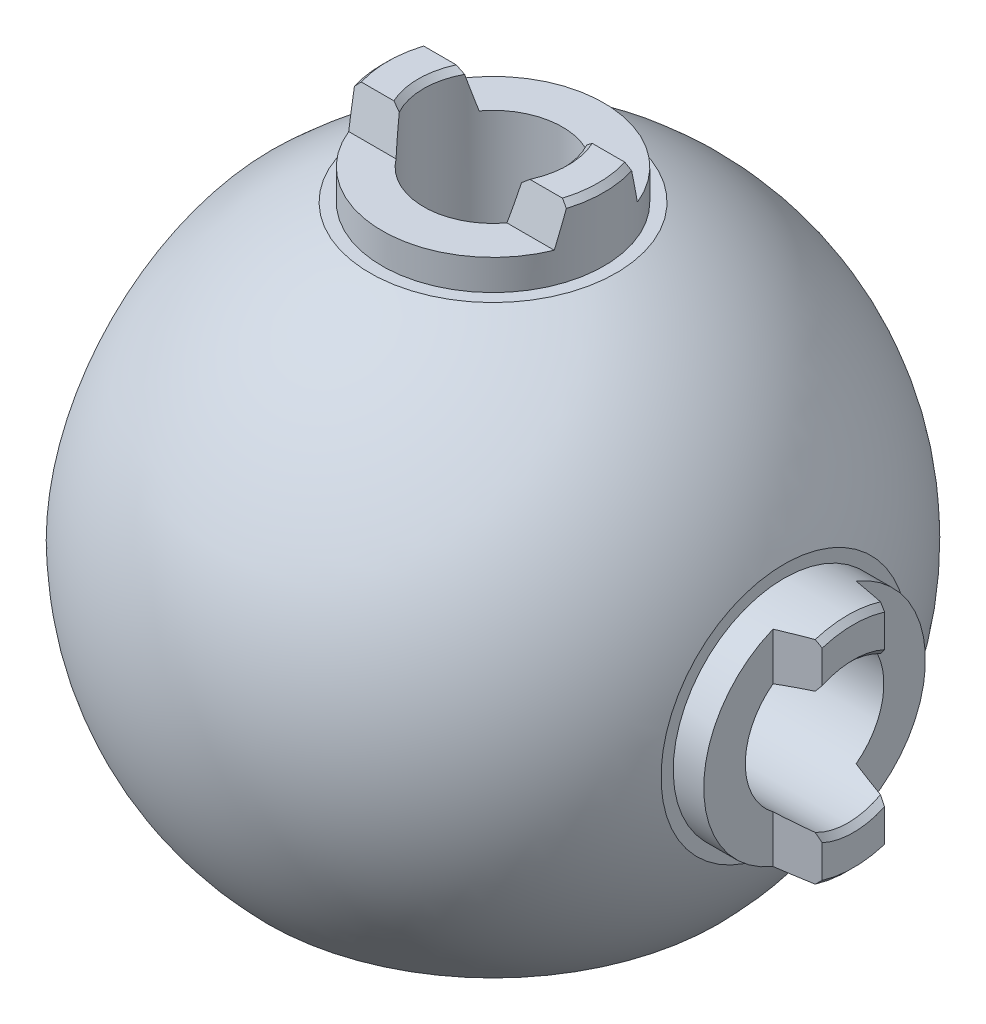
ISO-10303-21;
HEADER;
FILE_DESCRIPTION(('STEP AP214'),'2;1');
FILE_NAME('part.step','',(''),(''),'','','');
FILE_SCHEMA(('AUTOMOTIVE_DESIGN { 1 0 10303 214 1 1 1 1 }'));
ENDSEC;
DATA;
#1=APPLICATION_CONTEXT('core data for automotive mechanical design processes');
#2=APPLICATION_PROTOCOL_DEFINITION('international standard','automotive_design',2000,#1);
#3=PRODUCT_CONTEXT('',#1,'mechanical');
#4=PRODUCT('Part','Part','',(#3));
#5=PRODUCT_RELATED_PRODUCT_CATEGORY('part','',(#4));
#6=PRODUCT_DEFINITION_FORMATION('','',#4);
#7=PRODUCT_DEFINITION_CONTEXT('part definition',#1,'design');
#8=PRODUCT_DEFINITION('design','',#6,#7);
#9=PRODUCT_DEFINITION_SHAPE('','',#8);
#10=(LENGTH_UNIT() NAMED_UNIT(*) SI_UNIT(.MILLI.,.METRE.));
#11=(NAMED_UNIT(*) PLANE_ANGLE_UNIT() SI_UNIT($,.RADIAN.));
#12=(NAMED_UNIT(*) SI_UNIT($,.STERADIAN.) SOLID_ANGLE_UNIT());
#13=UNCERTAINTY_MEASURE_WITH_UNIT(LENGTH_MEASURE(1.E-05),#10,'distance_accuracy_value','');
#14=(GEOMETRIC_REPRESENTATION_CONTEXT(3) GLOBAL_UNCERTAINTY_ASSIGNED_CONTEXT((#13)) GLOBAL_UNIT_ASSIGNED_CONTEXT((#10,
#11,#12)) REPRESENTATION_CONTEXT('',''));
#15=CARTESIAN_POINT('',(0.,0.,0.));
#16=DIRECTION('',(0.,0.,1.));
#17=DIRECTION('',(1.,0.,0.));
#18=AXIS2_PLACEMENT_3D('',#15,#16,#17);
#19=CARTESIAN_POINT('',(0.,13.3500024,0.));
#20=DIRECTION('',(0.,-1.,0.));
#21=DIRECTION('',(1.,0.,0.));
#22=AXIS2_PLACEMENT_3D('',#19,#20,#21);
#23=CYLINDRICAL_SURFACE('',#22,1.6);
#24=CARTESIAN_POINT('',(0.,5.3,0.));
#25=DIRECTION('',(0.,-1.,0.));
#26=DIRECTION('',(1.,0.,0.));
#27=AXIS2_PLACEMENT_3D('',#24,#25,#26);
#28=CIRCLE('',#27,1.6);
#29=CARTESIAN_POINT('',(1.6,5.3,0.));
#30=VERTEX_POINT('',#29);
#31=EDGE_CURVE('E893',#30,#30,#28,.F.);
#32=ORIENTED_EDGE('',*,*,#31,.F.);
#33=EDGE_LOOP('',(#32));
#34=FACE_BOUND('',#33,.T.);
#35=CARTESIAN_POINT('',(0.,6.3,0.));
#36=DIRECTION('',(0.,-1.,0.));
#37=DIRECTION('',(1.,0.,0.));
#38=AXIS2_PLACEMENT_3D('',#35,#36,#37);
#39=CIRCLE('',#38,1.6);
#40=CARTESIAN_POINT('',(1.6,6.3,0.));
#41=VERTEX_POINT('',#40);
#42=EDGE_CURVE('E498',#41,#41,#39,.F.);
#43=ORIENTED_EDGE('',*,*,#42,.T.);
#44=EDGE_LOOP('',(#43));
#45=FACE_BOUND('',#44,.T.);
#46=ADVANCED_FACE('F15',(#34,#45),#23,.F.);
#47=CARTESIAN_POINT('',(13.,-3.2637337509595,-0.107448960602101));
#48=DIRECTION('',(1.,0.,0.));
#49=DIRECTION('',(0.,0.,-1.));
#50=AXIS2_PLACEMENT_3D('',#47,#48,#49);
#51=PLANE('',#50);
#52=CARTESIAN_POINT('',(12.9999999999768,0.,0.));
#53=DIRECTION('',(-1.,0.,0.));
#54=DIRECTION('',(0.,-1.,0.));
#55=AXIS2_PLACEMENT_3D('',#52,#53,#54);
#56=CIRCLE('',#55,3.79999999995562);
#57=CARTESIAN_POINT('',(12.9999999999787,-3.62969212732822,1.12487113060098));
#58=VERTEX_POINT('',#57);
#59=CARTESIAN_POINT('',(12.9999999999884,-3.62969212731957,-1.12487113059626));
#60=VERTEX_POINT('',#59);
#61=EDGE_CURVE('E19',#58,#60,#56,.F.);
#62=ORIENTED_EDGE('',*,*,#61,.T.);
#63=DIRECTION('',(0.,1.,0.));
#64=VECTOR('',#63,1.);
#65=CARTESIAN_POINT('',(13.,-3.2637337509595,-1.12487113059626));
#66=LINE('',#65,#64);
#67=CARTESIAN_POINT('',(12.9999999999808,-2.45451928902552,-1.12487113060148));
#68=VERTEX_POINT('',#67);
#69=EDGE_CURVE('E185',#60,#68,#66,.T.);
#70=ORIENTED_EDGE('',*,*,#69,.T.);
#71=CARTESIAN_POINT('',(12.9999999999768,0.,0.));
#72=DIRECTION('',(1.,0.,0.));
#73=DIRECTION('',(0.,1.,0.));
#74=AXIS2_PLACEMENT_3D('',#71,#72,#73);
#75=CIRCLE('',#74,2.70000000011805);
#76=CARTESIAN_POINT('',(12.9999999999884,-2.45451928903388,1.1248711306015));
#77=VERTEX_POINT('',#76);
#78=EDGE_CURVE('E209',#68,#77,#75,.F.);
#79=ORIENTED_EDGE('',*,*,#78,.T.);
#80=DIRECTION('',(0.,1.,0.));
#81=VECTOR('',#80,1.);
#82=CARTESIAN_POINT('',(13.,-3.2637337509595,1.12487113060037));
#83=LINE('',#82,#81);
#84=EDGE_CURVE('E197',#77,#58,#83,.F.);
#85=ORIENTED_EDGE('',*,*,#84,.T.);
#86=EDGE_LOOP('',(#62,#70,#79,#85));
#87=FACE_BOUND('',#86,.T.);
#88=ADVANCED_FACE('F207',(#87),#51,.T.);
#89=CARTESIAN_POINT('',(13.3500024,0.,0.));
#90=DIRECTION('',(-1.,0.,0.));
#91=DIRECTION('',(0.,-1.,0.));
#92=AXIS2_PLACEMENT_3D('',#89,#90,#91);
#93=CYLINDRICAL_SURFACE('',#92,1.6);
#94=CARTESIAN_POINT('',(6.3,0.,0.));
#95=DIRECTION('',(-1.,0.,0.));
#96=DIRECTION('',(0.,-1.,0.));
#97=AXIS2_PLACEMENT_3D('',#94,#95,#96);
#98=CIRCLE('',#97,1.6);
#99=CARTESIAN_POINT('',(6.3,-1.6,0.));
#100=VERTEX_POINT('',#99);
#101=EDGE_CURVE('E902',#100,#100,#98,.F.);
#102=ORIENTED_EDGE('',*,*,#101,.T.);
#103=EDGE_LOOP('',(#102));
#104=FACE_BOUND('',#103,.T.);
#105=CARTESIAN_POINT('',(5.3,0.,0.));
#106=DIRECTION('',(-1.,0.,0.));
#107=DIRECTION('',(0.,-1.,0.));
#108=AXIS2_PLACEMENT_3D('',#105,#106,#107);
#109=CIRCLE('',#108,1.6);
#110=CARTESIAN_POINT('',(5.3,-1.6,0.));
#111=VERTEX_POINT('',#110);
#112=EDGE_CURVE('E440',#111,#111,#109,.F.);
#113=ORIENTED_EDGE('',*,*,#112,.F.);
#114=EDGE_LOOP('',(#113));
#115=FACE_BOUND('',#114,.T.);
#116=ADVANCED_FACE('F521',(#104,#115),#93,.F.);
#117=CARTESIAN_POINT('',(0.542402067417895,5.3,3.3240495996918));
#118=DIRECTION('',(0.,-1.,0.));
#119=DIRECTION('',(1.,0.,0.));
#120=AXIS2_PLACEMENT_3D('',#117,#118,#119);
#121=PLANE('',#120);
#122=CARTESIAN_POINT('',(0.,5.3,0.));
#123=DIRECTION('',(0.,-1.,0.));
#124=DIRECTION('',(0.,0.,-1.));
#125=AXIS2_PLACEMENT_3D('',#122,#123,#124);
#126=CIRCLE('',#125,4.);
#127=CARTESIAN_POINT('',(0.,5.3,-4.));
#128=VERTEX_POINT('',#127);
#129=EDGE_CURVE('E437',#128,#128,#126,.T.);
#130=ORIENTED_EDGE('',*,*,#129,.T.);
#131=EDGE_LOOP('',(#130));
#132=FACE_BOUND('',#131,.T.);
#133=ORIENTED_EDGE('',*,*,#31,.T.);
#134=EDGE_LOOP('',(#133));
#135=FACE_BOUND('',#134,.T.);
#136=ADVANCED_FACE('F516',(#132,#135),#121,.T.);
#137=CARTESIAN_POINT('',(0.,12.99999999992,0.));
#138=DIRECTION('',(0.,1.,0.));
#139=DIRECTION('',(0.,0.,1.));
#140=AXIS2_PLACEMENT_3D('',#137,#138,#139);
#141=CONICAL_SURFACE('',#140,2.69999999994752,0.785398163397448);
#142=CARTESIAN_POINT('',(0.,12.7999999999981,0.));
#143=DIRECTION('',(0.,-1.,0.));
#144=DIRECTION('',(1.,0.,0.));
#145=AXIS2_PLACEMENT_3D('',#142,#143,#144);
#146=CIRCLE('',#145,2.5);
#147=CARTESIAN_POINT('',(-2.20481966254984,12.79999999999,1.17846096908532));
#148=VERTEX_POINT('',#147);
#149=CARTESIAN_POINT('',(-2.20481966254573,12.7999999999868,-1.17846096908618));
#150=VERTEX_POINT('',#149);
#151=EDGE_CURVE('E428',#148,#150,#146,.T.);
#152=ORIENTED_EDGE('',*,*,#151,.T.);
#153=CARTESIAN_POINT('',(-2.45451928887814,12.9999999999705,-1.12487113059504));
#154=CARTESIAN_POINT('',(-2.41327032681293,12.9662385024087,-1.13391749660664));
#155=CARTESIAN_POINT('',(-2.3718375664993,12.9326911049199,-1.14290649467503));
#156=CARTESIAN_POINT('',(-2.28860435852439,12.8660244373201,-1.16076977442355));
#157=CARTESIAN_POINT('',(-2.24680391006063,12.832905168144,-1.16964405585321));
#158=CARTESIAN_POINT('',(-2.20481966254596,12.7999999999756,-1.17846096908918));
#159=B_SPLINE_CURVE_WITH_KNOTS('',3,(#153,#154,#155,#156,#157,#158),.UNSPECIFIED.,.F.,.F.,(4,2,
4),(0.,0.162191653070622,0.32438366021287),.UNSPECIFIED.);
#160=CARTESIAN_POINT('',(-2.45451928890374,12.9999999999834,-1.12487113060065));
#161=VERTEX_POINT('',#160);
#162=EDGE_CURVE('E507',#161,#150,#159,.T.);
#163=ORIENTED_EDGE('',*,*,#162,.F.);
#164=CARTESIAN_POINT('',(0.,12.9999999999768,0.));
#165=DIRECTION('',(0.,1.,0.));
#166=DIRECTION('',(0.,0.,1.));
#167=AXIS2_PLACEMENT_3D('',#164,#165,#166);
#168=CIRCLE('',#167,2.70000000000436);
#169=CARTESIAN_POINT('',(-2.45451928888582,12.999999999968,1.12487113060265));
#170=VERTEX_POINT('',#169);
#171=EDGE_CURVE('E433',#170,#161,#168,.F.);
#172=ORIENTED_EDGE('',*,*,#171,.F.);
#173=CARTESIAN_POINT('',(-2.20481966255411,12.799999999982,1.17846096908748));
#174=CARTESIAN_POINT('',(-2.24680391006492,12.8329051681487,1.1696440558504));
#175=CARTESIAN_POINT('',(-2.28860435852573,12.8660244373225,1.16076977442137));
#176=CARTESIAN_POINT('',(-2.37183756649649,12.9326911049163,1.14290649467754));
#177=CARTESIAN_POINT('',(-2.41327032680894,12.9662385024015,1.13391749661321));
#178=CARTESIAN_POINT('',(-2.45451928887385,12.9999999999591,1.1248711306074));
#179=B_SPLINE_CURVE_WITH_KNOTS('',3,(#173,#174,#175,#176,#177,#178),.UNSPECIFIED.,.F.,.F.,(4,2,
4),(0.,0.162192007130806,0.324383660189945),.UNSPECIFIED.);
#180=EDGE_CURVE('E501',#148,#170,#179,.T.);
#181=ORIENTED_EDGE('',*,*,#180,.F.);
#182=EDGE_LOOP('',(#152,#163,#172,#181));
#183=FACE_BOUND('',#182,.T.);
#184=ADVANCED_FACE('F511',(#183),#141,.F.);
#185=CARTESIAN_POINT('',(0.542402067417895,6.3,3.3240495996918));
#186=DIRECTION('',(0.,-1.,0.));
#187=DIRECTION('',(1.,0.,0.));
#188=AXIS2_PLACEMENT_3D('',#185,#186,#187);
#189=PLANE('',#188);
#190=CARTESIAN_POINT('',(0.,6.3,0.));
#191=DIRECTION('',(0.,-1.,0.));
#192=DIRECTION('',(1.,0.,0.));
#193=AXIS2_PLACEMENT_3D('',#190,#191,#192);
#194=CIRCLE('',#193,2.5);
#195=CARTESIAN_POINT('',(2.5,6.3,0.));
#196=VERTEX_POINT('',#195);
#197=EDGE_CURVE('E425',#196,#196,#194,.F.);
#198=ORIENTED_EDGE('',*,*,#197,.T.);
#199=EDGE_LOOP('',(#198));
#200=FACE_BOUND('',#199,.T.);
#201=ORIENTED_EDGE('',*,*,#42,.F.);
#202=EDGE_LOOP('',(#201));
#203=FACE_BOUND('',#202,.T.);
#204=ADVANCED_FACE('F515',(#200,#203),#189,.F.);
#205=CARTESIAN_POINT('',(0.,12.9999999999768,0.));
#206=DIRECTION('',(0.,1.,0.));
#207=DIRECTION('',(0.,0.,1.));
#208=AXIS2_PLACEMENT_3D('',#205,#206,#207);
#209=CONICAL_SURFACE('',#208,2.7000000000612,0.785398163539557);
#210=CARTESIAN_POINT('',(0.,12.8000000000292,0.));
#211=DIRECTION('',(0.,-1.,0.));
#212=DIRECTION('',(1.,0.,0.));
#213=AXIS2_PLACEMENT_3D('',#210,#211,#212);
#214=CIRCLE('',#213,2.5);
#215=CARTESIAN_POINT('',(2.20481966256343,12.8000000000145,-1.17846096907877));
#216=VERTEX_POINT('',#215);
#217=CARTESIAN_POINT('',(2.20481966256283,12.800000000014,1.17846096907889));
#218=VERTEX_POINT('',#217);
#219=EDGE_CURVE('E424',#216,#218,#214,.T.);
#220=ORIENTED_EDGE('',*,*,#219,.T.);
#221=CARTESIAN_POINT('',(2.45451928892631,12.9999999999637,1.12487113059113));
#222=CARTESIAN_POINT('',(2.41327032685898,12.9662385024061,1.13391749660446));
#223=CARTESIAN_POINT('',(2.37183756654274,12.9326911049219,1.14290649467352));
#224=CARTESIAN_POINT('',(2.28860435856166,12.8660244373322,1.16076977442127));
#225=CARTESIAN_POINT('',(2.24680391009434,12.8329051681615,1.16964405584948));
#226=CARTESIAN_POINT('',(2.20481966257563,12.7999999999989,1.17846096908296));
#227=B_SPLINE_CURVE_WITH_KNOTS('',3,(#221,#222,#223,#224,#225,#226),.UNSPECIFIED.,.F.,.F.,(4,2,
4),(0.,0.162191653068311,0.324383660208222),.UNSPECIFIED.);
#228=CARTESIAN_POINT('',(2.45451928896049,12.9999999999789,1.12487113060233));
#229=VERTEX_POINT('',#228);
#230=EDGE_CURVE('E493',#229,#218,#227,.T.);
#231=ORIENTED_EDGE('',*,*,#230,.F.);
#232=CARTESIAN_POINT('',(0.,12.9999999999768,0.));
#233=DIRECTION('',(0.,1.,0.));
#234=DIRECTION('',(0.,0.,1.));
#235=AXIS2_PLACEMENT_3D('',#232,#233,#234);
#236=CIRCLE('',#235,2.7000000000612);
#237=CARTESIAN_POINT('',(2.45451928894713,12.999999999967,-1.12487113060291));
#238=VERTEX_POINT('',#237);
#239=EDGE_CURVE('E429',#238,#229,#236,.F.);
#240=ORIENTED_EDGE('',*,*,#239,.F.);
#241=CARTESIAN_POINT('',(2.20481966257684,12.7999999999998,-1.1784609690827));
#242=CARTESIAN_POINT('',(2.24680391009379,12.8329051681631,-1.16964405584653));
#243=CARTESIAN_POINT('',(2.28860435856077,12.8660244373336,-1.16076977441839));
#244=CARTESIAN_POINT('',(2.37183756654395,12.9326911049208,-1.14290649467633));
#245=CARTESIAN_POINT('',(2.41327032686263,12.9662385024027,-1.13391749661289));
#246=CARTESIAN_POINT('',(2.45451928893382,12.999999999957,-1.12487113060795));
#247=B_SPLINE_CURVE_WITH_KNOTS('',3,(#241,#242,#243,#244,#245,#246),.UNSPECIFIED.,.F.,.F.,(4,2,
4),(0.,0.162192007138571,0.324383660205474),.UNSPECIFIED.);
#248=EDGE_CURVE('E488',#216,#238,#247,.T.);
#249=ORIENTED_EDGE('',*,*,#248,.F.);
#250=EDGE_LOOP('',(#220,#231,#240,#249));
#251=FACE_BOUND('',#250,.T.);
#252=ADVANCED_FACE('F471',(#251),#209,.F.);
#253=CARTESIAN_POINT('',(13.0000000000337,0.,0.));
#254=DIRECTION('',(1.,0.,0.));
#255=DIRECTION('',(0.,1.,0.));
#256=AXIS2_PLACEMENT_3D('',#253,#254,#255);
#257=CONICAL_SURFACE('',#256,2.7000000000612,0.785398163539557);
#258=CARTESIAN_POINT('',(12.7999999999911,0.,0.));
#259=DIRECTION('',(-1.,0.,0.));
#260=DIRECTION('',(0.,-1.,0.));
#261=AXIS2_PLACEMENT_3D('',#258,#259,#260);
#262=CIRCLE('',#261,2.5);
#263=CARTESIAN_POINT('',(12.8000000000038,2.2048196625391,1.17846096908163));
#264=VERTEX_POINT('',#263);
#265=CARTESIAN_POINT('',(12.8000000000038,2.20481966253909,-1.17846096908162));
#266=VERTEX_POINT('',#265);
#267=EDGE_CURVE('E419',#264,#266,#262,.T.);
#268=ORIENTED_EDGE('',*,*,#267,.T.);
#269=CARTESIAN_POINT('',(13.0000000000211,2.45451928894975,-1.12487113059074));
#270=CARTESIAN_POINT('',(12.9662385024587,2.41327032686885,-1.13391749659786));
#271=CARTESIAN_POINT('',(12.9326911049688,2.37183756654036,-1.14290649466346));
#272=CARTESIAN_POINT('',(12.8660244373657,2.2886043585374,-1.16076977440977));
#273=CARTESIAN_POINT('',(12.8329051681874,2.24680391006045,-1.16964405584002));
#274=CARTESIAN_POINT('',(12.8000000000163,2.20481966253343,-1.17846096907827));
#275=B_SPLINE_CURVE_WITH_KNOTS('',3,(#269,#270,#271,#272,#273,#274),.UNSPECIFIED.,.F.,.F.,(4,2,
4),(0.,0.162191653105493,0.324383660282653),.UNSPECIFIED.);
#276=CARTESIAN_POINT('',(13.0000000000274,2.45451928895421,-1.12487113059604));
#277=VERTEX_POINT('',#276);
#278=EDGE_CURVE('E483',#277,#266,#275,.T.);
#279=ORIENTED_EDGE('',*,*,#278,.F.);
#280=CARTESIAN_POINT('',(13.0000000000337,0.,0.));
#281=DIRECTION('',(1.,0.,0.));
#282=DIRECTION('',(0.,1.,0.));
#283=AXIS2_PLACEMENT_3D('',#280,#281,#282);
#284=CIRCLE('',#283,2.7000000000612);
#285=CARTESIAN_POINT('',(13.0000000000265,2.45451928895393,1.12487113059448));
#286=VERTEX_POINT('',#285);
#287=EDGE_CURVE('E420',#286,#277,#284,.F.);
#288=ORIENTED_EDGE('',*,*,#287,.F.);
#289=CARTESIAN_POINT('',(12.8000000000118,2.20481966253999,1.17846096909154));
#290=CARTESIAN_POINT('',(12.8329051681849,2.24680391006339,1.16964405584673));
#291=CARTESIAN_POINT('',(12.8660244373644,2.2886043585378,1.16076977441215));
#292=CARTESIAN_POINT('',(12.9326911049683,2.37183756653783,1.14290649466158));
#293=CARTESIAN_POINT('',(12.966238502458,2.41327032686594,1.13391749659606));
#294=CARTESIAN_POINT('',(13.0000000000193,2.45451928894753,1.12487113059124));
#295=B_SPLINE_CURVE_WITH_KNOTS('',3,(#289,#290,#291,#292,#293,#294),.UNSPECIFIED.,.F.,.F.,(4,2,
4),(0.,0.162192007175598,0.324383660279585),.UNSPECIFIED.);
#296=EDGE_CURVE('E477',#264,#286,#295,.T.);
#297=ORIENTED_EDGE('',*,*,#296,.F.);
#298=EDGE_LOOP('',(#268,#279,#288,#297));
#299=FACE_BOUND('',#298,.T.);
#300=ADVANCED_FACE('F466',(#299),#257,.F.);
#301=CARTESIAN_POINT('',(6.3,0.542402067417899,-3.3240495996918));
#302=DIRECTION('',(-1.,0.,0.));
#303=DIRECTION('',(0.,-1.,0.));
#304=AXIS2_PLACEMENT_3D('',#301,#302,#303);
#305=PLANE('',#304);
#306=CARTESIAN_POINT('',(6.3,0.,0.));
#307=DIRECTION('',(-1.,0.,0.));
#308=DIRECTION('',(0.,-1.,0.));
#309=AXIS2_PLACEMENT_3D('',#306,#307,#308);
#310=CIRCLE('',#309,2.5);
#311=CARTESIAN_POINT('',(6.3,-2.5,0.));
#312=VERTEX_POINT('',#311);
#313=EDGE_CURVE('E416',#312,#312,#310,.F.);
#314=ORIENTED_EDGE('',*,*,#313,.T.);
#315=EDGE_LOOP('',(#314));
#316=FACE_BOUND('',#315,.T.);
#317=ORIENTED_EDGE('',*,*,#101,.F.);
#318=EDGE_LOOP('',(#317));
#319=FACE_BOUND('',#318,.T.);
#320=ADVANCED_FACE('F460',(#316,#319),#305,.F.);
#321=CARTESIAN_POINT('',(12.99999999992,0.,0.));
#322=DIRECTION('',(1.,0.,0.));
#323=DIRECTION('',(0.,1.,0.));
#324=AXIS2_PLACEMENT_3D('',#321,#322,#323);
#325=CONICAL_SURFACE('',#324,2.70000000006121,0.785398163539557);
#326=CARTESIAN_POINT('',(12.7999999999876,0.,0.));
#327=DIRECTION('',(-1.,0.,0.));
#328=DIRECTION('',(0.,-1.,0.));
#329=AXIS2_PLACEMENT_3D('',#326,#327,#328);
#330=CIRCLE('',#329,2.5);
#331=CARTESIAN_POINT('',(12.7999999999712,-2.204819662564,-1.17846096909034));
#332=VERTEX_POINT('',#331);
#333=CARTESIAN_POINT('',(12.7999999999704,-2.20481966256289,1.17846096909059));
#334=VERTEX_POINT('',#333);
#335=EDGE_CURVE('E415',#332,#334,#330,.T.);
#336=ORIENTED_EDGE('',*,*,#335,.T.);
#337=CARTESIAN_POINT('',(12.9999999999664,-2.45451928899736,1.1248711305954));
#338=CARTESIAN_POINT('',(12.9662385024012,-2.41327032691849,1.13391749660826));
#339=CARTESIAN_POINT('',(12.9326911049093,-2.37183756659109,1.14290649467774));
#340=CARTESIAN_POINT('',(12.8660244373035,-2.28860435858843,1.16076977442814));
#341=CARTESIAN_POINT('',(12.8329051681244,-2.24680391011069,1.16964405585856));
#342=CARTESIAN_POINT('',(12.7999999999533,-2.20481966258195,1.17846096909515));
#343=B_SPLINE_CURVE_WITH_KNOTS('',3,(#337,#338,#339,#340,#341,#342),.UNSPECIFIED.,.F.,.F.,(4,2,
4),(0.,0.162191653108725,0.324383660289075),.UNSPECIFIED.);
#344=EDGE_CURVE('E449',#77,#334,#343,.T.);
#345=ORIENTED_EDGE('',*,*,#344,.F.);
#346=ORIENTED_EDGE('',*,*,#78,.F.);
#347=CARTESIAN_POINT('',(12.799999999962,-2.204819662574,-1.17846096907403));
#348=CARTESIAN_POINT('',(12.8329051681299,-2.24680391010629,-1.16964405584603));
#349=CARTESIAN_POINT('',(12.8660244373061,-2.28860435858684,-1.16076977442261));
#350=CARTESIAN_POINT('',(12.9326911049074,-2.37183756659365,-1.14290649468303));
#351=CARTESIAN_POINT('',(12.9662385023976,-2.41327032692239,-1.13391749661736));
#352=CARTESIAN_POINT('',(12.9999999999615,-2.45451928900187,-1.12487113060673));
#353=B_SPLINE_CURVE_WITH_KNOTS('',3,(#347,#348,#349,#350,#351,#352),.UNSPECIFIED.,.F.,.F.,(4,2,
4),(0.,0.162192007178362,0.324383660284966),.UNSPECIFIED.);
#354=EDGE_CURVE('E443',#332,#68,#353,.T.);
#355=ORIENTED_EDGE('',*,*,#354,.F.);
#356=EDGE_LOOP('',(#336,#345,#346,#355));
#357=FACE_BOUND('',#356,.T.);
#358=ADVANCED_FACE('F454',(#357),#325,.F.);
#359=CARTESIAN_POINT('',(5.3,0.542402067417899,-3.3240495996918));
#360=DIRECTION('',(-1.,0.,0.));
#361=DIRECTION('',(0.,-1.,0.));
#362=AXIS2_PLACEMENT_3D('',#359,#360,#361);
#363=PLANE('',#362);
#364=ORIENTED_EDGE('',*,*,#112,.T.);
#365=EDGE_LOOP('',(#364));
#366=FACE_BOUND('',#365,.T.);
#367=CARTESIAN_POINT('',(5.3,0.,0.));
#368=DIRECTION('',(-1.,0.,0.));
#369=DIRECTION('',(0.,-1.,0.));
#370=AXIS2_PLACEMENT_3D('',#367,#368,#369);
#371=CIRCLE('',#370,4.);
#372=CARTESIAN_POINT('',(5.3,-4.,0.));
#373=VERTEX_POINT('',#372);
#374=EDGE_CURVE('E410',#373,#373,#371,.T.);
#375=ORIENTED_EDGE('',*,*,#374,.T.);
#376=EDGE_LOOP('',(#375));
#377=FACE_BOUND('',#376,.T.);
#378=ADVANCED_FACE('F459',(#366,#377),#363,.T.);
#379=CARTESIAN_POINT('',(0.,-8.,0.));
#380=DIRECTION('',(0.,-1.,0.));
#381=DIRECTION('',(0.,0.,-1.));
#382=AXIS2_PLACEMENT_3D('',#379,#380,#381);
#383=CYLINDRICAL_SURFACE('',#382,4.);
#384=CARTESIAN_POINT('',(0.,0.,0.));
#385=DIRECTION('',(-0.707106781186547,-0.707106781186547,0.));
#386=DIRECTION('',(0.707106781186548,-0.707106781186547,0.));
#387=AXIS2_PLACEMENT_3D('',#384,#385,#386);
#388=ELLIPSE('',#387,5.65685424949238,4.);
#389=CARTESIAN_POINT('',(0.,0.,4.00000000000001));
#390=VERTEX_POINT('',#389);
#391=CARTESIAN_POINT('',(0.,0.,-3.99999999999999));
#392=VERTEX_POINT('',#391);
#393=EDGE_CURVE('E407',#390,#392,#388,.T.);
#394=ORIENTED_EDGE('',*,*,#393,.T.);
#395=CARTESIAN_POINT('',(0.,0.,0.));
#396=DIRECTION('',(0.707106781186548,-0.707106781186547,0.));
#397=DIRECTION('',(-0.707106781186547,-0.707106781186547,0.));
#398=AXIS2_PLACEMENT_3D('',#395,#396,#397);
#399=ELLIPSE('',#398,5.65685424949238,4.);
#400=EDGE_CURVE('E413',#392,#390,#399,.T.);
#401=ORIENTED_EDGE('',*,*,#400,.T.);
#402=EDGE_LOOP('',(#394,#401));
#403=FACE_BOUND('',#402,.T.);
#404=ORIENTED_EDGE('',*,*,#129,.F.);
#405=EDGE_LOOP('',(#404));
#406=FACE_BOUND('',#405,.T.);
#407=ADVANCED_FACE('F815',(#403,#406),#383,.F.);
#408=CARTESIAN_POINT('',(-3.2637337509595,13.,0.107448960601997));
#409=DIRECTION('',(0.,1.,0.));
#410=DIRECTION('',(0.,0.,1.));
#411=AXIS2_PLACEMENT_3D('',#408,#409,#410);
#412=PLANE('',#411);
#413=DIRECTION('',(1.,0.,0.));
#414=VECTOR('',#413,1.);
#415=CARTESIAN_POINT('',(-4.8000024,12.9999999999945,1.12487113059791));
#416=LINE('',#415,#414);
#417=CARTESIAN_POINT('',(-3.62969212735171,13.0000000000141,1.12487113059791));
#418=VERTEX_POINT('',#417);
#419=EDGE_CURVE('E406',#418,#170,#416,.T.);
#420=ORIENTED_EDGE('',*,*,#419,.T.);
#421=ORIENTED_EDGE('',*,*,#171,.T.);
#422=DIRECTION('',(1.,0.,0.));
#423=VECTOR('',#422,1.);
#424=CARTESIAN_POINT('',(-3.2637337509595,13.,-1.12487113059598));
#425=LINE('',#424,#423);
#426=CARTESIAN_POINT('',(-3.6296921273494,13.0000000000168,-1.12487113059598));
#427=VERTEX_POINT('',#426);
#428=EDGE_CURVE('E436',#161,#427,#425,.F.);
#429=ORIENTED_EDGE('',*,*,#428,.T.);
#430=CARTESIAN_POINT('',(0.,13.0000000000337,0.));
#431=DIRECTION('',(0.,-1.,0.));
#432=DIRECTION('',(1.,0.,0.));
#433=AXIS2_PLACEMENT_3D('',#430,#431,#432);
#434=CIRCLE('',#433,3.79999999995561);
#435=EDGE_CURVE('E402',#418,#427,#434,.T.);
#436=ORIENTED_EDGE('',*,*,#435,.F.);
#437=EDGE_LOOP('',(#420,#421,#429,#436));
#438=FACE_BOUND('',#437,.T.);
#439=ADVANCED_FACE('F624',(#438),#412,.T.);
#440=CARTESIAN_POINT('',(-3.2637337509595,13.,0.107448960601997));
#441=DIRECTION('',(0.,1.,0.));
#442=DIRECTION('',(0.,0.,1.));
#443=AXIS2_PLACEMENT_3D('',#440,#441,#442);
#444=PLANE('',#443);
#445=DIRECTION('',(1.,0.,0.));
#446=VECTOR('',#445,1.);
#447=CARTESIAN_POINT('',(-4.8000024,12.9999999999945,-1.12487113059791));
#448=LINE('',#447,#446);
#449=CARTESIAN_POINT('',(3.62969212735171,13.0000000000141,-1.12487113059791));
#450=VERTEX_POINT('',#449);
#451=EDGE_CURVE('E371',#450,#238,#448,.F.);
#452=ORIENTED_EDGE('',*,*,#451,.T.);
#453=ORIENTED_EDGE('',*,*,#239,.T.);
#454=DIRECTION('',(1.,0.,0.));
#455=VECTOR('',#454,1.);
#456=CARTESIAN_POINT('',(-3.2637337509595,13.,1.12487113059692));
#457=LINE('',#456,#455);
#458=CARTESIAN_POINT('',(3.62969212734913,13.0000000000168,1.12487113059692));
#459=VERTEX_POINT('',#458);
#460=EDGE_CURVE('E432',#229,#459,#457,.T.);
#461=ORIENTED_EDGE('',*,*,#460,.T.);
#462=CARTESIAN_POINT('',(0.,13.0000000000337,0.));
#463=DIRECTION('',(0.,-1.,0.));
#464=DIRECTION('',(0.,0.,-1.));
#465=AXIS2_PLACEMENT_3D('',#462,#463,#464);
#466=CIRCLE('',#465,3.79999999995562);
#467=EDGE_CURVE('E367',#450,#459,#466,.T.);
#468=ORIENTED_EDGE('',*,*,#467,.F.);
#469=EDGE_LOOP('',(#452,#453,#461,#468));
#470=FACE_BOUND('',#469,.T.);
#471=ADVANCED_FACE('F800',(#470),#444,.T.);
#472=CARTESIAN_POINT('',(0.,11.6,0.));
#473=DIRECTION('',(0.,-1.,0.));
#474=DIRECTION('',(1.,0.,0.));
#475=AXIS2_PLACEMENT_3D('',#472,#473,#474);
#476=CYLINDRICAL_SURFACE('',#475,2.5);
#477=CARTESIAN_POINT('',(0.,11.6,0.));
#478=DIRECTION('',(0.,-1.,0.));
#479=DIRECTION('',(1.,0.,0.));
#480=AXIS2_PLACEMENT_3D('',#477,#478,#479);
#481=CIRCLE('',#480,2.5);
#482=CARTESIAN_POINT('',(2.,11.6,-1.5));
#483=VERTEX_POINT('',#482);
#484=CARTESIAN_POINT('',(-2.,11.6,-1.5));
#485=VERTEX_POINT('',#484);
#486=EDGE_CURVE('E372',#483,#485,#481,.F.);
#487=ORIENTED_EDGE('',*,*,#486,.T.);
#488=CARTESIAN_POINT('',(0.,17.1980762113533,0.));
#489=DIRECTION('',(0.,-0.258819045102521,0.965925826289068));
#490=DIRECTION('',(0.,-0.965925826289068,-0.258819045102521));
#491=AXIS2_PLACEMENT_3D('',#488,#489,#490);
#492=ELLIPSE('',#491,9.65925826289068,2.5);
#493=EDGE_CURVE('E382',#485,#150,#492,.F.);
#494=ORIENTED_EDGE('',*,*,#493,.T.);
#495=ORIENTED_EDGE('',*,*,#151,.F.);
#496=CARTESIAN_POINT('',(0.,17.1980762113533,0.));
#497=DIRECTION('',(0.,-0.258819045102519,-0.965925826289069));
#498=DIRECTION('',(0.,-0.965925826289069,0.258819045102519));
#499=AXIS2_PLACEMENT_3D('',#496,#497,#498);
#500=ELLIPSE('',#499,9.65925826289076,2.5);
#501=CARTESIAN_POINT('',(-2.00000000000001,11.6,1.49999999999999));
#502=VERTEX_POINT('',#501);
#503=EDGE_CURVE('E403',#148,#502,#500,.F.);
#504=ORIENTED_EDGE('',*,*,#503,.T.);
#505=CARTESIAN_POINT('',(0.,11.6,0.));
#506=DIRECTION('',(0.,-1.,0.));
#507=DIRECTION('',(1.,0.,0.));
#508=AXIS2_PLACEMENT_3D('',#505,#506,#507);
#509=CIRCLE('',#508,2.5);
#510=CARTESIAN_POINT('',(2.00000000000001,11.6,1.49999999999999));
#511=VERTEX_POINT('',#510);
#512=EDGE_CURVE('E336',#502,#511,#509,.F.);
#513=ORIENTED_EDGE('',*,*,#512,.T.);
#514=CARTESIAN_POINT('',(0.,17.1980762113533,0.));
#515=DIRECTION('',(0.,-0.258819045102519,-0.965925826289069));
#516=DIRECTION('',(0.,-0.965925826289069,0.258819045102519));
#517=AXIS2_PLACEMENT_3D('',#514,#515,#516);
#518=ELLIPSE('',#517,9.65925826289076,2.5);
#519=EDGE_CURVE('E347',#511,#218,#518,.F.);
#520=ORIENTED_EDGE('',*,*,#519,.T.);
#521=ORIENTED_EDGE('',*,*,#219,.F.);
#522=CARTESIAN_POINT('',(0.,17.1980762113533,0.));
#523=DIRECTION('',(0.,-0.258819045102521,0.965925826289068));
#524=DIRECTION('',(0.,-0.965925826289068,-0.258819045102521));
#525=AXIS2_PLACEMENT_3D('',#522,#523,#524);
#526=ELLIPSE('',#525,9.65925826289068,2.5);
#527=EDGE_CURVE('E369',#216,#483,#526,.F.);
#528=ORIENTED_EDGE('',*,*,#527,.T.);
#529=EDGE_LOOP('',(#487,#494,#495,#504,#513,#520,#521,#528));
#530=FACE_BOUND('',#529,.T.);
#531=ORIENTED_EDGE('',*,*,#197,.F.);
#532=EDGE_LOOP('',(#531));
#533=FACE_BOUND('',#532,.T.);
#534=ADVANCED_FACE('F792',(#530,#533),#476,.F.);
#535=CARTESIAN_POINT('',(13.,-3.2637337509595,-0.107448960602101));
#536=DIRECTION('',(1.,0.,0.));
#537=DIRECTION('',(0.,0.,-1.));
#538=AXIS2_PLACEMENT_3D('',#535,#536,#537);
#539=PLANE('',#538);
#540=CARTESIAN_POINT('',(12.99999999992,0.,0.));
#541=DIRECTION('',(-1.,0.,0.));
#542=DIRECTION('',(0.,0.,1.));
#543=AXIS2_PLACEMENT_3D('',#540,#541,#542);
#544=CIRCLE('',#543,3.80000000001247);
#545=CARTESIAN_POINT('',(12.9999999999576,3.62969212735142,1.12487113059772));
#546=VERTEX_POINT('',#545);
#547=CARTESIAN_POINT('',(12.99999999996,3.62969212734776,-1.12487113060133));
#548=VERTEX_POINT('',#547);
#549=EDGE_CURVE('E331',#546,#548,#544,.T.);
#550=ORIENTED_EDGE('',*,*,#549,.F.);
#551=DIRECTION('',(0.,1.,0.));
#552=VECTOR('',#551,1.);
#553=CARTESIAN_POINT('',(12.9999999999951,-4.8000024,1.12487113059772));
#554=LINE('',#553,#552);
#555=EDGE_CURVE('E335',#546,#286,#554,.F.);
#556=ORIENTED_EDGE('',*,*,#555,.T.);
#557=ORIENTED_EDGE('',*,*,#287,.T.);
#558=DIRECTION('',(0.,1.,0.));
#559=VECTOR('',#558,1.);
#560=CARTESIAN_POINT('',(13.,-3.2637337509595,-1.12487113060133));
#561=LINE('',#560,#559);
#562=EDGE_CURVE('E423',#277,#548,#561,.T.);
#563=ORIENTED_EDGE('',*,*,#562,.T.);
#564=EDGE_LOOP('',(#550,#556,#557,#563));
#565=FACE_BOUND('',#564,.T.);
#566=ADVANCED_FACE('F785',(#565),#539,.T.);
#567=CARTESIAN_POINT('',(11.6,0.,0.));
#568=DIRECTION('',(-1.,0.,0.));
#569=DIRECTION('',(0.,-1.,0.));
#570=AXIS2_PLACEMENT_3D('',#567,#568,#569);
#571=CYLINDRICAL_SURFACE('',#570,2.5);
#572=CARTESIAN_POINT('',(17.1980762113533,0.,0.));
#573=DIRECTION('',(-0.258819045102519,0.,0.965925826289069));
#574=DIRECTION('',(-0.965925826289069,0.,-0.258819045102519));
#575=AXIS2_PLACEMENT_3D('',#572,#573,#574);
#576=ELLIPSE('',#575,9.65925826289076,2.5);
#577=CARTESIAN_POINT('',(11.6,-2.00000000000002,-1.49999999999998));
#578=VERTEX_POINT('',#577);
#579=EDGE_CURVE('E298',#332,#578,#576,.F.);
#580=ORIENTED_EDGE('',*,*,#579,.T.);
#581=CARTESIAN_POINT('',(11.6,0.,0.));
#582=DIRECTION('',(-1.,0.,0.));
#583=DIRECTION('',(0.,-1.,0.));
#584=AXIS2_PLACEMENT_3D('',#581,#582,#583);
#585=CIRCLE('',#584,2.5);
#586=CARTESIAN_POINT('',(11.6,2.00000000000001,-1.49999999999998));
#587=VERTEX_POINT('',#586);
#588=EDGE_CURVE('E302',#578,#587,#585,.F.);
#589=ORIENTED_EDGE('',*,*,#588,.T.);
#590=CARTESIAN_POINT('',(17.1980762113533,0.,0.));
#591=DIRECTION('',(-0.258819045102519,0.,0.965925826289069));
#592=DIRECTION('',(-0.965925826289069,0.,-0.258819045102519));
#593=AXIS2_PLACEMENT_3D('',#590,#591,#592);
#594=ELLIPSE('',#593,9.65925826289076,2.5);
#595=EDGE_CURVE('E311',#587,#266,#594,.F.);
#596=ORIENTED_EDGE('',*,*,#595,.T.);
#597=ORIENTED_EDGE('',*,*,#267,.F.);
#598=CARTESIAN_POINT('',(17.1980762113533,0.,0.));
#599=DIRECTION('',(-0.258819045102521,0.,-0.965925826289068));
#600=DIRECTION('',(-0.965925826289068,0.,0.258819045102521));
#601=AXIS2_PLACEMENT_3D('',#598,#599,#600);
#602=ELLIPSE('',#601,9.65925826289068,2.5);
#603=CARTESIAN_POINT('',(11.6,2.00000000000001,1.5));
#604=VERTEX_POINT('',#603);
#605=EDGE_CURVE('E332',#264,#604,#602,.F.);
#606=ORIENTED_EDGE('',*,*,#605,.T.);
#607=CARTESIAN_POINT('',(11.6,0.,0.));
#608=DIRECTION('',(-1.,0.,0.));
#609=DIRECTION('',(0.,-1.,0.));
#610=AXIS2_PLACEMENT_3D('',#607,#608,#609);
#611=CIRCLE('',#610,2.5);
#612=CARTESIAN_POINT('',(11.6,-2.00000000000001,1.49999999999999));
#613=VERTEX_POINT('',#612);
#614=EDGE_CURVE('E276',#604,#613,#611,.F.);
#615=ORIENTED_EDGE('',*,*,#614,.T.);
#616=CARTESIAN_POINT('',(17.1980762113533,0.,0.));
#617=DIRECTION('',(-0.258819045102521,0.,-0.965925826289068));
#618=DIRECTION('',(-0.965925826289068,0.,0.258819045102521));
#619=AXIS2_PLACEMENT_3D('',#616,#617,#618);
#620=ELLIPSE('',#619,9.65925826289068,2.5);
#621=EDGE_CURVE('E205',#613,#334,#620,.F.);
#622=ORIENTED_EDGE('',*,*,#621,.T.);
#623=ORIENTED_EDGE('',*,*,#335,.F.);
#624=EDGE_LOOP('',(#580,#589,#596,#597,#606,#615,#622,#623));
#625=FACE_BOUND('',#624,.T.);
#626=ORIENTED_EDGE('',*,*,#313,.F.);
#627=EDGE_LOOP('',(#626));
#628=FACE_BOUND('',#627,.T.);
#629=ADVANCED_FACE('F589',(#625,#628),#571,.F.);
#630=CARTESIAN_POINT('',(-8.00000000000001,0.,0.));
#631=DIRECTION('',(-1.,0.,0.));
#632=DIRECTION('',(0.,-1.,0.));
#633=AXIS2_PLACEMENT_3D('',#630,#631,#632);
#634=CYLINDRICAL_SURFACE('',#633,4.);
#635=ORIENTED_EDGE('',*,*,#374,.F.);
#636=EDGE_LOOP('',(#635));
#637=FACE_BOUND('',#636,.T.);
#638=ORIENTED_EDGE('',*,*,#400,.F.);
#639=CARTESIAN_POINT('',(0.,0.,0.));
#640=DIRECTION('',(-0.707106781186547,-0.707106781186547,0.));
#641=DIRECTION('',(-0.707106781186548,0.707106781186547,0.));
#642=AXIS2_PLACEMENT_3D('',#639,#640,#641);
#643=ELLIPSE('',#642,5.65685424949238,4.);
#644=EDGE_CURVE('E269',#392,#390,#643,.T.);
#645=ORIENTED_EDGE('',*,*,#644,.T.);
#646=EDGE_LOOP('',(#638,#645));
#647=FACE_BOUND('',#646,.T.);
#648=ADVANCED_FACE('F771',(#637,#647),#634,.F.);
#649=CARTESIAN_POINT('',(-8.00000000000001,0.,0.));
#650=DIRECTION('',(-1.,0.,0.));
#651=DIRECTION('',(0.,-1.,0.));
#652=AXIS2_PLACEMENT_3D('',#649,#650,#651);
#653=CYLINDRICAL_SURFACE('',#652,4.);
#654=CARTESIAN_POINT('',(0.,0.,0.));
#655=DIRECTION('',(-0.707106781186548,0.707106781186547,0.));
#656=DIRECTION('',(-0.707106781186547,-0.707106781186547,0.));
#657=AXIS2_PLACEMENT_3D('',#654,#655,#656);
#658=ELLIPSE('',#657,5.65685424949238,4.);
#659=EDGE_CURVE('E272',#390,#392,#658,.F.);
#660=ORIENTED_EDGE('',*,*,#659,.T.);
#661=ORIENTED_EDGE('',*,*,#393,.F.);
#662=EDGE_LOOP('',(#660,#661));
#663=FACE_BOUND('',#662,.T.);
#664=CARTESIAN_POINT('',(-8.00000000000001,0.,0.));
#665=DIRECTION('',(-1.,0.,0.));
#666=DIRECTION('',(0.,-1.,0.));
#667=AXIS2_PLACEMENT_3D('',#664,#665,#666);
#668=CIRCLE('',#667,4.);
#669=CARTESIAN_POINT('',(-8.00000000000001,-4.,0.));
#670=VERTEX_POINT('',#669);
#671=EDGE_CURVE('E266',#670,#670,#668,.T.);
#672=ORIENTED_EDGE('',*,*,#671,.T.);
#673=EDGE_LOOP('',(#672));
#674=FACE_BOUND('',#673,.T.);
#675=ADVANCED_FACE('F764',(#663,#674),#653,.F.);
#676=CARTESIAN_POINT('',(-4.8000024,17.1980762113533,0.));
#677=DIRECTION('',(0.,-0.258819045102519,-0.965925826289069));
#678=DIRECTION('',(0.,0.965925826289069,-0.258819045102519));
#679=AXIS2_PLACEMENT_3D('',#676,#677,#678);
#680=PLANE('',#679);
#681=CARTESIAN_POINT('',(0.,17.1980762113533,0.));
#682=DIRECTION('',(0.,-0.258819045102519,-0.965925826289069));
#683=DIRECTION('',(0.,0.965925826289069,-0.258819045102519));
#684=AXIS2_PLACEMENT_3D('',#681,#682,#683);
#685=ELLIPSE('',#684,15.4548132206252,4.00000000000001);
#686=CARTESIAN_POINT('',(-3.70809924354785,11.6,1.49999999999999));
#687=VERTEX_POINT('',#686);
#688=CARTESIAN_POINT('',(-3.82246383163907,12.7999999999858,1.17846096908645));
#689=VERTEX_POINT('',#688);
#690=EDGE_CURVE('E263',#687,#689,#685,.T.);
#691=ORIENTED_EDGE('',*,*,#690,.F.);
#692=DIRECTION('',(1.,0.,0.));
#693=VECTOR('',#692,1.);
#694=CARTESIAN_POINT('',(-4.8000024,11.6,1.49999999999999));
#695=LINE('',#694,#693);
#696=EDGE_CURVE('E339',#687,#502,#695,.T.);
#697=ORIENTED_EDGE('',*,*,#696,.T.);
#698=ORIENTED_EDGE('',*,*,#503,.F.);
#699=ORIENTED_EDGE('',*,*,#180,.T.);
#700=ORIENTED_EDGE('',*,*,#419,.F.);
#701=CARTESIAN_POINT('',(-3.82246383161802,12.7999999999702,1.17846096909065));
#702=CARTESIAN_POINT('',(-3.79033560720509,12.8333336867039,1.16952923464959));
#703=CARTESIAN_POINT('',(-3.75820718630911,12.8666671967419,1.16059754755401));
#704=CARTESIAN_POINT('',(-3.69394995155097,12.9333338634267,1.14273426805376));
#705=CARTESIAN_POINT('',(-3.66182113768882,12.9666670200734,1.1338026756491));
#706=CARTESIAN_POINT('',(-3.6296921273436,13.0000000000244,1.1248711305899));
#707=B_SPLINE_CURVE_WITH_KNOTS('',3,(#701,#702,#703,#704,#705,#706),.UNSPECIFIED.,.F.,.F.,(4,2,
4),(0.,0.141450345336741,0.282900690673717),.UNSPECIFIED.);
#708=EDGE_CURVE('E396',#689,#418,#707,.T.);
#709=ORIENTED_EDGE('',*,*,#708,.F.);
#710=EDGE_LOOP('',(#691,#697,#698,#699,#700,#709));
#711=FACE_BOUND('',#710,.T.);
#712=ADVANCED_FACE('F390',(#711),#680,.F.);
#713=CARTESIAN_POINT('',(0.,12.7999999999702,0.));
#714=DIRECTION('',(0.,-1.,0.));
#715=DIRECTION('',(1.,0.,0.));
#716=AXIS2_PLACEMENT_3D('',#713,#714,#715);
#717=CONICAL_SURFACE('',#716,3.99999999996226,0.78539816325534);
#718=ORIENTED_EDGE('',*,*,#435,.T.);
#719=CARTESIAN_POINT('',(-3.62969212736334,13.0000000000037,-1.12487113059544));
#720=CARTESIAN_POINT('',(-3.66182113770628,12.9666670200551,-1.13380267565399));
#721=CARTESIAN_POINT('',(-3.69394995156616,12.9333338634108,-1.142734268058));
#722=CARTESIAN_POINT('',(-3.75820718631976,12.8666671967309,-1.16059754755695));
#723=CARTESIAN_POINT('',(-3.79033560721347,12.8333336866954,-1.16952923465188));
#724=CARTESIAN_POINT('',(-3.82246383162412,12.7999999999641,-1.17846096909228));
#725=B_SPLINE_CURVE_WITH_KNOTS('',3,(#719,#720,#721,#722,#723,#724),.UNSPECIFIED.,.F.,.F.,(4,2,
4),(0.,0.14145034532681,0.282900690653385),.UNSPECIFIED.);
#726=CARTESIAN_POINT('',(-3.82246383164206,12.7999999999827,-1.17846096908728));
#727=VERTEX_POINT('',#726);
#728=EDGE_CURVE('E375',#427,#727,#725,.T.);
#729=ORIENTED_EDGE('',*,*,#728,.T.);
#730=CARTESIAN_POINT('',(0.,12.8000000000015,0.));
#731=DIRECTION('',(0.,1.,0.));
#732=DIRECTION('',(-1.,0.,0.));
#733=AXIS2_PLACEMENT_3D('',#730,#731,#732);
#734=CIRCLE('',#733,4.00000000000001);
#735=EDGE_CURVE('E262',#689,#727,#734,.F.);
#736=ORIENTED_EDGE('',*,*,#735,.F.);
#737=ORIENTED_EDGE('',*,*,#708,.T.);
#738=EDGE_LOOP('',(#718,#729,#736,#737));
#739=FACE_BOUND('',#738,.T.);
#740=ADVANCED_FACE('F386',(#739),#717,.T.);
#741=CARTESIAN_POINT('',(-4.8000024,11.6,-1.5));
#742=DIRECTION('',(0.,-0.258819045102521,0.965925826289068));
#743=DIRECTION('',(0.,-0.965925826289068,-0.258819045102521));
#744=AXIS2_PLACEMENT_3D('',#741,#742,#743);
#745=PLANE('',#744);
#746=ORIENTED_EDGE('',*,*,#728,.F.);
#747=ORIENTED_EDGE('',*,*,#428,.F.);
#748=ORIENTED_EDGE('',*,*,#162,.T.);
#749=ORIENTED_EDGE('',*,*,#493,.F.);
#750=DIRECTION('',(1.,0.,0.));
#751=VECTOR('',#750,1.);
#752=CARTESIAN_POINT('',(-4.8000024,11.6,-1.5));
#753=LINE('',#752,#751);
#754=CARTESIAN_POINT('',(-3.70809924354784,11.6,-1.5));
#755=VERTEX_POINT('',#754);
#756=EDGE_CURVE('E374',#485,#755,#753,.F.);
#757=ORIENTED_EDGE('',*,*,#756,.T.);
#758=CARTESIAN_POINT('',(0.,17.1980762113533,0.));
#759=DIRECTION('',(0.,-0.258819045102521,0.965925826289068));
#760=DIRECTION('',(0.,0.965925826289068,0.258819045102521));
#761=AXIS2_PLACEMENT_3D('',#758,#759,#760);
#762=ELLIPSE('',#761,15.4548132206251,4.00000000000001);
#763=EDGE_CURVE('E259',#727,#755,#762,.T.);
#764=ORIENTED_EDGE('',*,*,#763,.F.);
#765=EDGE_LOOP('',(#746,#747,#748,#749,#757,#764));
#766=FACE_BOUND('',#765,.T.);
#767=ADVANCED_FACE('F384',(#766),#745,.F.);
#768=CARTESIAN_POINT('',(-4.8000024,11.6,-5.7940245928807));
#769=DIRECTION('',(0.,-1.,0.));
#770=DIRECTION('',(1.,0.,0.));
#771=AXIS2_PLACEMENT_3D('',#768,#769,#770);
#772=PLANE('',#771);
#773=DIRECTION('',(1.,0.,0.));
#774=VECTOR('',#773,1.);
#775=CARTESIAN_POINT('',(-4.8000024,11.6,-1.5));
#776=LINE('',#775,#774);
#777=CARTESIAN_POINT('',(3.70809924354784,11.6,-1.5));
#778=VERTEX_POINT('',#777);
#779=EDGE_CURVE('E368',#483,#778,#776,.T.);
#780=ORIENTED_EDGE('',*,*,#779,.T.);
#781=CARTESIAN_POINT('',(0.,11.6,0.));
#782=DIRECTION('',(0.,1.,0.));
#783=DIRECTION('',(-1.,0.,0.));
#784=AXIS2_PLACEMENT_3D('',#781,#782,#783);
#785=CIRCLE('',#784,4.00000000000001);
#786=EDGE_CURVE('E256',#755,#778,#785,.F.);
#787=ORIENTED_EDGE('',*,*,#786,.F.);
#788=ORIENTED_EDGE('',*,*,#756,.F.);
#789=ORIENTED_EDGE('',*,*,#486,.F.);
#790=EDGE_LOOP('',(#780,#787,#788,#789));
#791=FACE_BOUND('',#790,.T.);
#792=ADVANCED_FACE('F742',(#791),#772,.F.);
#793=CARTESIAN_POINT('',(-4.8000024,11.6,-1.5));
#794=DIRECTION('',(0.,-0.258819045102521,0.965925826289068));
#795=DIRECTION('',(0.,-0.965925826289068,-0.258819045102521));
#796=AXIS2_PLACEMENT_3D('',#793,#794,#795);
#797=PLANE('',#796);
#798=CARTESIAN_POINT('',(0.,17.1980762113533,0.));
#799=DIRECTION('',(0.,-0.258819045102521,0.965925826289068));
#800=DIRECTION('',(0.,0.965925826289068,0.258819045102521));
#801=AXIS2_PLACEMENT_3D('',#798,#799,#800);
#802=ELLIPSE('',#801,15.4548132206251,4.00000000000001);
#803=CARTESIAN_POINT('',(3.82246383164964,12.8000000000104,-1.17846096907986));
#804=VERTEX_POINT('',#803);
#805=EDGE_CURVE('E253',#778,#804,#802,.T.);
#806=ORIENTED_EDGE('',*,*,#805,.F.);
#807=ORIENTED_EDGE('',*,*,#779,.F.);
#808=ORIENTED_EDGE('',*,*,#527,.F.);
#809=ORIENTED_EDGE('',*,*,#248,.T.);
#810=ORIENTED_EDGE('',*,*,#451,.F.);
#811=CARTESIAN_POINT('',(3.82246383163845,12.8000000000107,-1.17846096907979));
#812=CARTESIAN_POINT('',(3.79033560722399,12.8333336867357,-1.16952923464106));
#813=CARTESIAN_POINT('',(3.75820718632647,12.8666671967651,-1.1605975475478));
#814=CARTESIAN_POINT('',(3.69394995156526,12.9333338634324,-1.14273426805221));
#815=CARTESIAN_POINT('',(3.66182113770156,12.9666670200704,-1.13380267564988));
#816=CARTESIAN_POINT('',(3.62969212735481,13.0000000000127,-1.12487113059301));
#817=B_SPLINE_CURVE_WITH_KNOTS('',3,(#811,#812,#813,#814,#815,#816),.UNSPECIFIED.,.F.,.F.,(4,2,
4),(0.,0.141450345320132,0.2829006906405),.UNSPECIFIED.);
#818=EDGE_CURVE('E361',#804,#450,#817,.T.);
#819=ORIENTED_EDGE('',*,*,#818,.F.);
#820=EDGE_LOOP('',(#806,#807,#808,#809,#810,#819));
#821=FACE_BOUND('',#820,.T.);
#822=ADVANCED_FACE('F355',(#821),#797,.F.);
#823=CARTESIAN_POINT('',(0.,12.8000000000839,0.));
#824=DIRECTION('',(0.,-1.,0.));
#825=DIRECTION('',(0.,0.,-1.));
#826=AXIS2_PLACEMENT_3D('',#823,#824,#825);
#827=CONICAL_SURFACE('',#826,3.99999999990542,0.785398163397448);
#828=ORIENTED_EDGE('',*,*,#467,.T.);
#829=CARTESIAN_POINT('',(3.62969212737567,12.9999999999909,1.12487113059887));
#830=CARTESIAN_POINT('',(3.66182113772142,12.9666670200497,1.13380267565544));
#831=CARTESIAN_POINT('',(3.69394995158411,12.9333338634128,1.14273426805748));
#832=CARTESIAN_POINT('',(3.75820718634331,12.8666671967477,1.16059754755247));
#833=CARTESIAN_POINT('',(3.79033560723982,12.8333336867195,1.16952923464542));
#834=CARTESIAN_POINT('',(3.82246383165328,12.7999999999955,1.17846096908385));
#835=B_SPLINE_CURVE_WITH_KNOTS('',3,(#829,#830,#831,#832,#833,#834),.UNSPECIFIED.,.F.,.F.,(4,2,
4),(0.,0.141450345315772,0.282900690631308),.UNSPECIFIED.);
#836=CARTESIAN_POINT('',(3.822463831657,12.8000000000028,1.17846096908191));
#837=VERTEX_POINT('',#836);
#838=EDGE_CURVE('E340',#459,#837,#835,.T.);
#839=ORIENTED_EDGE('',*,*,#838,.T.);
#840=CARTESIAN_POINT('',(0.,12.8000000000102,0.));
#841=DIRECTION('',(0.,1.,0.));
#842=DIRECTION('',(-1.,0.,0.));
#843=AXIS2_PLACEMENT_3D('',#840,#841,#842);
#844=CIRCLE('',#843,4.00000000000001);
#845=EDGE_CURVE('E252',#804,#837,#844,.F.);
#846=ORIENTED_EDGE('',*,*,#845,.F.);
#847=ORIENTED_EDGE('',*,*,#818,.T.);
#848=EDGE_LOOP('',(#828,#839,#846,#847));
#849=FACE_BOUND('',#848,.T.);
#850=ADVANCED_FACE('F351',(#849),#827,.T.);
#851=CARTESIAN_POINT('',(-4.8000024,17.1980762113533,0.));
#852=DIRECTION('',(0.,-0.258819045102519,-0.965925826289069));
#853=DIRECTION('',(0.,0.965925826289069,-0.258819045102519));
#854=AXIS2_PLACEMENT_3D('',#851,#852,#853);
#855=PLANE('',#854);
#856=ORIENTED_EDGE('',*,*,#838,.F.);
#857=ORIENTED_EDGE('',*,*,#460,.F.);
#858=ORIENTED_EDGE('',*,*,#230,.T.);
#859=ORIENTED_EDGE('',*,*,#519,.F.);
#860=DIRECTION('',(1.,0.,0.));
#861=VECTOR('',#860,1.);
#862=CARTESIAN_POINT('',(-4.8000024,11.6,1.49999999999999));
#863=LINE('',#862,#861);
#864=CARTESIAN_POINT('',(3.70809924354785,11.6,1.49999999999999));
#865=VERTEX_POINT('',#864);
#866=EDGE_CURVE('E338',#511,#865,#863,.T.);
#867=ORIENTED_EDGE('',*,*,#866,.T.);
#868=CARTESIAN_POINT('',(0.,17.1980762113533,0.));
#869=DIRECTION('',(0.,-0.258819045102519,-0.965925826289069));
#870=DIRECTION('',(0.,0.965925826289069,-0.258819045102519));
#871=AXIS2_PLACEMENT_3D('',#868,#869,#870);
#872=ELLIPSE('',#871,15.4548132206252,4.00000000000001);
#873=EDGE_CURVE('E249',#837,#865,#872,.T.);
#874=ORIENTED_EDGE('',*,*,#873,.F.);
#875=EDGE_LOOP('',(#856,#857,#858,#859,#867,#874));
#876=FACE_BOUND('',#875,.T.);
#877=ADVANCED_FACE('F349',(#876),#855,.F.);
#878=CARTESIAN_POINT('',(-4.8000024,11.6,1.49999999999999));
#879=DIRECTION('',(0.,-1.,0.));
#880=DIRECTION('',(0.,0.,-1.));
#881=AXIS2_PLACEMENT_3D('',#878,#879,#880);
#882=PLANE('',#881);
#883=ORIENTED_EDGE('',*,*,#866,.F.);
#884=ORIENTED_EDGE('',*,*,#512,.F.);
#885=ORIENTED_EDGE('',*,*,#696,.F.);
#886=CARTESIAN_POINT('',(0.,11.6,0.));
#887=DIRECTION('',(0.,1.,0.));
#888=DIRECTION('',(-1.,0.,0.));
#889=AXIS2_PLACEMENT_3D('',#886,#887,#888);
#890=CIRCLE('',#889,4.00000000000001);
#891=EDGE_CURVE('E247',#865,#687,#890,.F.);
#892=ORIENTED_EDGE('',*,*,#891,.F.);
#893=EDGE_LOOP('',(#883,#884,#885,#892));
#894=FACE_BOUND('',#893,.T.);
#895=ADVANCED_FACE('F720',(#894),#882,.F.);
#896=CARTESIAN_POINT('',(11.6,-4.8000024,1.49999999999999));
#897=DIRECTION('',(-0.258819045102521,0.,-0.965925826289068));
#898=DIRECTION('',(-0.965925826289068,0.,0.258819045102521));
#899=AXIS2_PLACEMENT_3D('',#896,#897,#898);
#900=PLANE('',#899);
#901=CARTESIAN_POINT('',(17.1980762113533,0.,0.));
#902=DIRECTION('',(-0.258819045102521,0.,-0.965925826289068));
#903=DIRECTION('',(0.965925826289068,0.,-0.258819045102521));
#904=AXIS2_PLACEMENT_3D('',#901,#902,#903);
#905=ELLIPSE('',#904,15.4548132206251,4.00000000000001);
#906=CARTESIAN_POINT('',(11.6,3.70809924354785,1.5));
#907=VERTEX_POINT('',#906);
#908=CARTESIAN_POINT('',(12.8000000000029,3.822463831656,1.17846096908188));
#909=VERTEX_POINT('',#908);
#910=EDGE_CURVE('E244',#907,#909,#905,.T.);
#911=ORIENTED_EDGE('',*,*,#910,.F.);
#912=DIRECTION('',(0.,-1.,0.));
#913=VECTOR('',#912,1.);
#914=CARTESIAN_POINT('',(11.6,-4.8000024,1.5));
#915=LINE('',#914,#913);
#916=EDGE_CURVE('E204',#907,#604,#915,.T.);
#917=ORIENTED_EDGE('',*,*,#916,.T.);
#918=ORIENTED_EDGE('',*,*,#605,.F.);
#919=ORIENTED_EDGE('',*,*,#296,.T.);
#920=ORIENTED_EDGE('',*,*,#555,.F.);
#921=CARTESIAN_POINT('',(12.7999999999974,3.82246383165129,1.17846096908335));
#922=CARTESIAN_POINT('',(12.8333336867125,3.79033560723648,1.16952923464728));
#923=CARTESIAN_POINT('',(12.8666671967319,3.75820718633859,1.16059754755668));
#924=CARTESIAN_POINT('',(12.9333338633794,3.69394995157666,1.1427342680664));
#925=CARTESIAN_POINT('',(12.9666670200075,3.6618211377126,1.13380267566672));
#926=CARTESIAN_POINT('',(12.9999999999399,3.62969212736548,1.12487113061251));
#927=B_SPLINE_CURVE_WITH_KNOTS('',3,(#921,#922,#923,#924,#925,#926),.UNSPECIFIED.,.F.,.F.,(4,2,
4),(0.,0.141450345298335,0.282900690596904),.UNSPECIFIED.);
#928=EDGE_CURVE('E325',#909,#546,#927,.T.);
#929=ORIENTED_EDGE('',*,*,#928,.F.);
#930=EDGE_LOOP('',(#911,#917,#918,#919,#920,#929));
#931=FACE_BOUND('',#930,.T.);
#932=ADVANCED_FACE('F319',(#931),#900,.F.);
#933=CARTESIAN_POINT('',(12.8000000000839,0.,0.));
#934=DIRECTION('',(-1.,0.,0.));
#935=DIRECTION('',(0.,0.,1.));
#936=AXIS2_PLACEMENT_3D('',#933,#934,#935);
#937=CONICAL_SURFACE('',#936,3.99999999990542,0.785398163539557);
#938=ORIENTED_EDGE('',*,*,#549,.T.);
#939=CARTESIAN_POINT('',(12.9999999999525,3.62969212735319,-1.12487113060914));
#940=CARTESIAN_POINT('',(12.9666670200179,3.6618211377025,-1.13380267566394));
#941=CARTESIAN_POINT('',(12.9333338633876,3.69394995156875,-1.14273426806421));
#942=CARTESIAN_POINT('',(12.8666671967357,3.75820718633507,-1.16059754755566));
#943=CARTESIAN_POINT('',(12.833333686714,3.79033560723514,-1.16952923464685));
#944=CARTESIAN_POINT('',(12.7999999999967,3.82246383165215,-1.17846096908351));
#945=B_SPLINE_CURVE_WITH_KNOTS('',3,(#939,#940,#941,#942,#943,#944),.UNSPECIFIED.,.F.,.F.,(4,2,
4),(0.,0.141450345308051,0.282900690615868),.UNSPECIFIED.);
#946=CARTESIAN_POINT('',(12.8000000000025,3.82246383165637,-1.17846096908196));
#947=VERTEX_POINT('',#946);
#948=EDGE_CURVE('E304',#548,#947,#945,.T.);
#949=ORIENTED_EDGE('',*,*,#948,.T.);
#950=CARTESIAN_POINT('',(12.8000000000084,0.,0.));
#951=DIRECTION('',(1.,0.,0.));
#952=DIRECTION('',(0.,1.,0.));
#953=AXIS2_PLACEMENT_3D('',#950,#951,#952);
#954=CIRCLE('',#953,4.00000000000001);
#955=EDGE_CURVE('E243',#909,#947,#954,.F.);
#956=ORIENTED_EDGE('',*,*,#955,.F.);
#957=ORIENTED_EDGE('',*,*,#928,.T.);
#958=EDGE_LOOP('',(#938,#949,#956,#957));
#959=FACE_BOUND('',#958,.T.);
#960=ADVANCED_FACE('F315',(#959),#937,.T.);
#961=CARTESIAN_POINT('',(17.1980762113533,-4.8000024,0.));
#962=DIRECTION('',(-0.258819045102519,0.,0.965925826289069));
#963=DIRECTION('',(0.965925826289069,0.,0.258819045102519));
#964=AXIS2_PLACEMENT_3D('',#961,#962,#963);
#965=PLANE('',#964);
#966=ORIENTED_EDGE('',*,*,#948,.F.);
#967=ORIENTED_EDGE('',*,*,#562,.F.);
#968=ORIENTED_EDGE('',*,*,#278,.T.);
#969=ORIENTED_EDGE('',*,*,#595,.F.);
#970=DIRECTION('',(0.,1.,0.));
#971=VECTOR('',#970,1.);
#972=CARTESIAN_POINT('',(11.6,-4.8000024,-1.49999999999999));
#973=LINE('',#972,#971);
#974=CARTESIAN_POINT('',(11.6,3.70809924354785,-1.49999999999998));
#975=VERTEX_POINT('',#974);
#976=EDGE_CURVE('E301',#587,#975,#973,.T.);
#977=ORIENTED_EDGE('',*,*,#976,.T.);
#978=CARTESIAN_POINT('',(17.1980762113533,0.,0.));
#979=DIRECTION('',(-0.258819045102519,0.,0.965925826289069));
#980=DIRECTION('',(0.965925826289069,0.,0.258819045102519));
#981=AXIS2_PLACEMENT_3D('',#978,#979,#980);
#982=ELLIPSE('',#981,15.4548132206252,4.00000000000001);
#983=EDGE_CURVE('E240',#947,#975,#982,.T.);
#984=ORIENTED_EDGE('',*,*,#983,.F.);
#985=EDGE_LOOP('',(#966,#967,#968,#969,#977,#984));
#986=FACE_BOUND('',#985,.T.);
#987=ADVANCED_FACE('F313',(#986),#965,.F.);
#988=CARTESIAN_POINT('',(11.6,-4.8000024,-1.5));
#989=DIRECTION('',(-1.,0.,0.));
#990=DIRECTION('',(0.,0.,1.));
#991=AXIS2_PLACEMENT_3D('',#988,#989,#990);
#992=PLANE('',#991);
#993=CARTESIAN_POINT('',(11.6,0.,0.));
#994=DIRECTION('',(1.,0.,0.));
#995=DIRECTION('',(0.,1.,0.));
#996=AXIS2_PLACEMENT_3D('',#993,#994,#995);
#997=CIRCLE('',#996,4.00000000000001);
#998=CARTESIAN_POINT('',(11.6,-3.70809924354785,-1.49999999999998));
#999=VERTEX_POINT('',#998);
#1000=EDGE_CURVE('E237',#975,#999,#997,.F.);
#1001=ORIENTED_EDGE('',*,*,#1000,.F.);
#1002=ORIENTED_EDGE('',*,*,#976,.F.);
#1003=ORIENTED_EDGE('',*,*,#588,.F.);
#1004=DIRECTION('',(0.,1.,0.));
#1005=VECTOR('',#1004,1.);
#1006=CARTESIAN_POINT('',(11.6,-4.8000024,-1.49999999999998));
#1007=LINE('',#1006,#1005);
#1008=EDGE_CURVE('E297',#578,#999,#1007,.F.);
#1009=ORIENTED_EDGE('',*,*,#1008,.T.);
#1010=EDGE_LOOP('',(#1001,#1002,#1003,#1009));
#1011=FACE_BOUND('',#1010,.T.);
#1012=ADVANCED_FACE('F698',(#1011),#992,.F.);
#1013=CARTESIAN_POINT('',(17.1980762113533,-4.8000024,0.));
#1014=DIRECTION('',(-0.258819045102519,0.,0.965925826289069));
#1015=DIRECTION('',(0.965925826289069,0.,0.258819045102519));
#1016=AXIS2_PLACEMENT_3D('',#1013,#1014,#1015);
#1017=PLANE('',#1016);
#1018=CARTESIAN_POINT('',(17.1980762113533,0.,0.));
#1019=DIRECTION('',(-0.258819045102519,0.,0.965925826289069));
#1020=DIRECTION('',(0.965925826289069,0.,0.258819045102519));
#1021=AXIS2_PLACEMENT_3D('',#1018,#1019,#1020);
#1022=ELLIPSE('',#1021,15.4548132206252,4.00000000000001);
#1023=CARTESIAN_POINT('',(12.7999999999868,-3.82246383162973,-1.17846096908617));
#1024=VERTEX_POINT('',#1023);
#1025=EDGE_CURVE('E234',#999,#1024,#1022,.T.);
#1026=ORIENTED_EDGE('',*,*,#1025,.F.);
#1027=ORIENTED_EDGE('',*,*,#1008,.F.);
#1028=ORIENTED_EDGE('',*,*,#579,.F.);
#1029=ORIENTED_EDGE('',*,*,#354,.T.);
#1030=ORIENTED_EDGE('',*,*,#69,.F.);
#1031=CARTESIAN_POINT('',(12.7999999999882,-3.82246383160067,-1.1784609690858));
#1032=CARTESIAN_POINT('',(12.8333336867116,-3.79033560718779,-1.16952923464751));
#1033=CARTESIAN_POINT('',(12.8666671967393,-3.75820718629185,-1.1605975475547));
#1034=CARTESIAN_POINT('',(12.9333338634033,-3.6939499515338,-1.14273426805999));
#1035=CARTESIAN_POINT('',(12.9666670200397,-3.66182113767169,-1.13380267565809));
#1036=CARTESIAN_POINT('',(12.9999999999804,-3.62969212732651,-1.12487113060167));
#1037=B_SPLINE_CURVE_WITH_KNOTS('',3,(#1031,#1032,#1033,#1034,#1035,#1036),.UNSPECIFIED.,.F.,
.F.,(4,2,4),(0.,0.14145034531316,0.282900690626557),.UNSPECIFIED.);
#1038=EDGE_CURVE('E194',#1024,#60,#1037,.T.);
#1039=ORIENTED_EDGE('',*,*,#1038,.F.);
#1040=EDGE_LOOP('',(#1026,#1027,#1028,#1029,#1030,#1039));
#1041=FACE_BOUND('',#1040,.T.);
#1042=ADVANCED_FACE('F289',(#1041),#1017,.F.);
#1043=CARTESIAN_POINT('',(12.8000000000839,0.,0.));
#1044=DIRECTION('',(-1.,0.,0.));
#1045=DIRECTION('',(0.,-1.,0.));
#1046=AXIS2_PLACEMENT_3D('',#1043,#1044,#1045);
#1047=CONICAL_SURFACE('',#1046,3.99999999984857,0.785398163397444);
#1048=CARTESIAN_POINT('',(12.9999999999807,-3.62969212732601,1.1248711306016));
#1049=CARTESIAN_POINT('',(12.9666670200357,-3.66182113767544,1.13380267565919));
#1050=CARTESIAN_POINT('',(12.9333338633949,-3.69394995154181,1.14273426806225));
#1051=CARTESIAN_POINT('',(12.8666671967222,-3.75820718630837,1.16059754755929));
#1052=CARTESIAN_POINT('',(12.8333336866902,-3.79033560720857,1.16952923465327));
#1053=CARTESIAN_POINT('',(12.7999999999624,-3.82246383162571,1.17846096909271));
#1054=B_SPLINE_CURVE_WITH_KNOTS('',3,(#1048,#1049,#1050,#1051,#1052,#1053),.UNSPECIFIED.,.F.,
.F.,(4,2,4),(0.,0.141450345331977,0.28290069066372),.UNSPECIFIED.);
#1055=CARTESIAN_POINT('',(12.7999999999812,-3.8224638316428,1.17846096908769));
#1056=VERTEX_POINT('',#1055);
#1057=EDGE_CURVE('E192',#58,#1056,#1054,.T.);
#1058=ORIENTED_EDGE('',*,*,#1057,.T.);
#1059=CARTESIAN_POINT('',(12.8,0.,0.));
#1060=DIRECTION('',(1.,0.,0.));
#1061=DIRECTION('',(0.,1.,0.));
#1062=AXIS2_PLACEMENT_3D('',#1059,#1060,#1061);
#1063=CIRCLE('',#1062,4.00000000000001);
#1064=EDGE_CURVE('E233',#1024,#1056,#1063,.F.);
#1065=ORIENTED_EDGE('',*,*,#1064,.F.);
#1066=ORIENTED_EDGE('',*,*,#1038,.T.);
#1067=ORIENTED_EDGE('',*,*,#61,.F.);
#1068=EDGE_LOOP('',(#1058,#1065,#1066,#1067));
#1069=FACE_BOUND('',#1068,.T.);
#1070=ADVANCED_FACE('F191',(#1069),#1047,.T.);
#1071=CARTESIAN_POINT('',(11.6,-4.8000024,1.49999999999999));
#1072=DIRECTION('',(-0.258819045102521,0.,-0.965925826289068));
#1073=DIRECTION('',(-0.965925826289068,0.,0.258819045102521));
#1074=AXIS2_PLACEMENT_3D('',#1071,#1072,#1073);
#1075=PLANE('',#1074);
#1076=ORIENTED_EDGE('',*,*,#1057,.F.);
#1077=ORIENTED_EDGE('',*,*,#84,.F.);
#1078=ORIENTED_EDGE('',*,*,#344,.T.);
#1079=ORIENTED_EDGE('',*,*,#621,.F.);
#1080=DIRECTION('',(0.,-1.,0.));
#1081=VECTOR('',#1080,1.);
#1082=CARTESIAN_POINT('',(11.6,-4.8000024,1.49999999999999));
#1083=LINE('',#1082,#1081);
#1084=CARTESIAN_POINT('',(11.6,-3.70809924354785,1.49999999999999));
#1085=VERTEX_POINT('',#1084);
#1086=EDGE_CURVE('E275',#613,#1085,#1083,.T.);
#1087=ORIENTED_EDGE('',*,*,#1086,.T.);
#1088=CARTESIAN_POINT('',(17.1980762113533,0.,0.));
#1089=DIRECTION('',(-0.258819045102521,0.,-0.965925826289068));
#1090=DIRECTION('',(0.965925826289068,0.,-0.258819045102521));
#1091=AXIS2_PLACEMENT_3D('',#1088,#1089,#1090);
#1092=ELLIPSE('',#1091,15.4548132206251,4.00000000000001);
#1093=EDGE_CURVE('E202',#1056,#1085,#1092,.T.);
#1094=ORIENTED_EDGE('',*,*,#1093,.F.);
#1095=EDGE_LOOP('',(#1076,#1077,#1078,#1079,#1087,#1094));
#1096=FACE_BOUND('',#1095,.T.);
#1097=ADVANCED_FACE('F199',(#1096),#1075,.F.);
#1098=CARTESIAN_POINT('',(11.6,-4.8000024,5.7940245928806));
#1099=DIRECTION('',(-1.,0.,0.));
#1100=DIRECTION('',(0.,-1.,0.));
#1101=AXIS2_PLACEMENT_3D('',#1098,#1099,#1100);
#1102=PLANE('',#1101);
#1103=ORIENTED_EDGE('',*,*,#614,.F.);
#1104=ORIENTED_EDGE('',*,*,#916,.F.);
#1105=CARTESIAN_POINT('',(11.6,0.,0.));
#1106=DIRECTION('',(1.,0.,0.));
#1107=DIRECTION('',(0.,1.,0.));
#1108=AXIS2_PLACEMENT_3D('',#1105,#1106,#1107);
#1109=CIRCLE('',#1108,4.00000000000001);
#1110=EDGE_CURVE('E230',#1085,#907,#1109,.F.);
#1111=ORIENTED_EDGE('',*,*,#1110,.F.);
#1112=ORIENTED_EDGE('',*,*,#1086,.F.);
#1113=EDGE_LOOP('',(#1103,#1104,#1111,#1112));
#1114=FACE_BOUND('',#1113,.T.);
#1115=ADVANCED_FACE('F572',(#1114),#1102,.F.);
#1116=CARTESIAN_POINT('',(0.,-8.,0.));
#1117=DIRECTION('',(0.,-1.,0.));
#1118=DIRECTION('',(0.,0.,-1.));
#1119=AXIS2_PLACEMENT_3D('',#1116,#1117,#1118);
#1120=CYLINDRICAL_SURFACE('',#1119,4.);
#1121=ORIENTED_EDGE('',*,*,#644,.F.);
#1122=ORIENTED_EDGE('',*,*,#659,.F.);
#1123=EDGE_LOOP('',(#1121,#1122));
#1124=FACE_BOUND('',#1123,.T.);
#1125=CARTESIAN_POINT('',(0.,-8.,0.));
#1126=DIRECTION('',(0.,-1.,0.));
#1127=DIRECTION('',(0.,0.,-1.));
#1128=AXIS2_PLACEMENT_3D('',#1125,#1126,#1127);
#1129=CIRCLE('',#1128,4.);
#1130=CARTESIAN_POINT('',(0.,-8.,-4.));
#1131=VERTEX_POINT('',#1130);
#1132=EDGE_CURVE('E226',#1131,#1131,#1129,.T.);
#1133=ORIENTED_EDGE('',*,*,#1132,.T.);
#1134=EDGE_LOOP('',(#1133));
#1135=FACE_BOUND('',#1134,.T.);
#1136=ADVANCED_FACE('F566',(#1124,#1135),#1120,.F.);
#1137=CARTESIAN_POINT('',(-8.00000000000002,10.,-13.2000012));
#1138=DIRECTION('',(1.,0.,0.));
#1139=DIRECTION('',(0.,1.,0.));
#1140=AXIS2_PLACEMENT_3D('',#1137,#1138,#1139);
#1141=PLANE('',#1140);
#1142=ORIENTED_EDGE('',*,*,#671,.F.);
#1143=EDGE_LOOP('',(#1142));
#1144=FACE_BOUND('',#1143,.T.);
#1145=DIRECTION('',(0.,0.,1.));
#1146=VECTOR('',#1145,1.);
#1147=CARTESIAN_POINT('',(-8.00000000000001,-8.,-13.2000012));
#1148=LINE('',#1147,#1146);
#1149=CARTESIAN_POINT('',(-8.00000000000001,-8.,-1.39999999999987));
#1150=VERTEX_POINT('',#1149);
#1151=CARTESIAN_POINT('',(-8.00000000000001,-7.99999999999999,1.39999999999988));
#1152=VERTEX_POINT('',#1151);
#1153=EDGE_CURVE('E229',#1150,#1152,#1148,.T.);
#1154=ORIENTED_EDGE('',*,*,#1153,.T.);
#1155=CARTESIAN_POINT('',(-8.00000000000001,0.,0.));
#1156=DIRECTION('',(1.,0.,0.));
#1157=DIRECTION('',(0.,1.,0.));
#1158=AXIS2_PLACEMENT_3D('',#1155,#1156,#1157);
#1159=CIRCLE('',#1158,8.12157620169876);
#1160=EDGE_CURVE('E224',#1150,#1152,#1159,.T.);
#1161=ORIENTED_EDGE('',*,*,#1160,.F.);
#1162=EDGE_LOOP('',(#1154,#1161));
#1163=FACE_BOUND('',#1162,.T.);
#1164=ADVANCED_FACE('F557',(#1144,#1163),#1141,.F.);
#1165=CARTESIAN_POINT('',(0.,11.6,0.));
#1166=DIRECTION('',(0.,1.,0.));
#1167=DIRECTION('',(-1.,0.,0.));
#1168=AXIS2_PLACEMENT_3D('',#1165,#1166,#1167);
#1169=CYLINDRICAL_SURFACE('',#1168,4.00000000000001);
#1170=ORIENTED_EDGE('',*,*,#763,.T.);
#1171=ORIENTED_EDGE('',*,*,#786,.T.);
#1172=ORIENTED_EDGE('',*,*,#805,.T.);
#1173=ORIENTED_EDGE('',*,*,#845,.T.);
#1174=ORIENTED_EDGE('',*,*,#873,.T.);
#1175=ORIENTED_EDGE('',*,*,#891,.T.);
#1176=ORIENTED_EDGE('',*,*,#690,.T.);
#1177=ORIENTED_EDGE('',*,*,#735,.T.);
#1178=EDGE_LOOP('',(#1170,#1171,#1172,#1173,#1174,#1175,#1176,#1177));
#1179=FACE_BOUND('',#1178,.T.);
#1180=CARTESIAN_POINT('',(0.,10.5,0.));
#1181=DIRECTION('',(0.,1.,0.));
#1182=DIRECTION('',(-1.,0.,0.));
#1183=AXIS2_PLACEMENT_3D('',#1180,#1181,#1182);
#1184=CIRCLE('',#1183,4.00000000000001);
#1185=CARTESIAN_POINT('',(-4.00000000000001,10.5,0.));
#1186=VERTEX_POINT('',#1185);
#1187=EDGE_CURVE('E221',#1186,#1186,#1184,.T.);
#1188=ORIENTED_EDGE('',*,*,#1187,.T.);
#1189=EDGE_LOOP('',(#1188));
#1190=FACE_BOUND('',#1189,.T.);
#1191=ADVANCED_FACE('F554',(#1179,#1190),#1169,.T.);
#1192=CARTESIAN_POINT('',(11.6,0.,0.));
#1193=DIRECTION('',(1.,0.,0.));
#1194=DIRECTION('',(0.,1.,0.));
#1195=AXIS2_PLACEMENT_3D('',#1192,#1193,#1194);
#1196=CYLINDRICAL_SURFACE('',#1195,4.00000000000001);
#1197=ORIENTED_EDGE('',*,*,#983,.T.);
#1198=ORIENTED_EDGE('',*,*,#1000,.T.);
#1199=ORIENTED_EDGE('',*,*,#1025,.T.);
#1200=ORIENTED_EDGE('',*,*,#1064,.T.);
#1201=ORIENTED_EDGE('',*,*,#1093,.T.);
#1202=ORIENTED_EDGE('',*,*,#1110,.T.);
#1203=ORIENTED_EDGE('',*,*,#910,.T.);
#1204=ORIENTED_EDGE('',*,*,#955,.T.);
#1205=EDGE_LOOP('',(#1197,#1198,#1199,#1200,#1201,#1202,#1203,#1204));
#1206=FACE_BOUND('',#1205,.T.);
#1207=CARTESIAN_POINT('',(10.5,0.,0.));
#1208=DIRECTION('',(1.,0.,0.));
#1209=DIRECTION('',(0.,1.,0.));
#1210=AXIS2_PLACEMENT_3D('',#1207,#1208,#1209);
#1211=CIRCLE('',#1210,4.00000000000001);
#1212=CARTESIAN_POINT('',(10.5,4.00000000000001,0.));
#1213=VERTEX_POINT('',#1212);
#1214=EDGE_CURVE('E218',#1213,#1213,#1211,.F.);
#1215=ORIENTED_EDGE('',*,*,#1214,.F.);
#1216=EDGE_LOOP('',(#1215));
#1217=FACE_BOUND('',#1216,.T.);
#1218=ADVANCED_FACE('F556',(#1206,#1217),#1196,.T.);
#1219=CARTESIAN_POINT('',(-8.00000000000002,-8.,-13.2000012));
#1220=DIRECTION('',(0.,1.,0.));
#1221=DIRECTION('',(0.,0.,1.));
#1222=AXIS2_PLACEMENT_3D('',#1219,#1220,#1221);
#1223=PLANE('',#1222);
#1224=ORIENTED_EDGE('',*,*,#1132,.F.);
#1225=EDGE_LOOP('',(#1224));
#1226=FACE_BOUND('',#1225,.T.);
#1227=ORIENTED_EDGE('',*,*,#1153,.F.);
#1228=CARTESIAN_POINT('',(0.,-8.,0.));
#1229=DIRECTION('',(0.,-1.,0.));
#1230=DIRECTION('',(0.,0.,-1.));
#1231=AXIS2_PLACEMENT_3D('',#1228,#1229,#1230);
#1232=CIRCLE('',#1231,8.12157620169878);
#1233=EDGE_CURVE('E33',#1152,#1150,#1232,.F.);
#1234=ORIENTED_EDGE('',*,*,#1233,.F.);
#1235=EDGE_LOOP('',(#1227,#1234));
#1236=FACE_BOUND('',#1235,.T.);
#1237=ADVANCED_FACE('F550',(#1226,#1236),#1223,.F.);
#1238=CARTESIAN_POINT('',(9.5094132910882,10.5,-13.2000012));
#1239=DIRECTION('',(0.,-1.,0.));
#1240=DIRECTION('',(0.,0.,-1.));
#1241=AXIS2_PLACEMENT_3D('',#1238,#1239,#1240);
#1242=PLANE('',#1241);
#1243=CARTESIAN_POINT('',(0.,10.5,0.));
#1244=DIRECTION('',(0.,-1.,0.));
#1245=DIRECTION('',(0.,0.,-1.));
#1246=AXIS2_PLACEMENT_3D('',#1243,#1244,#1245);
#1247=CIRCLE('',#1246,4.43959457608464);
#1248=CARTESIAN_POINT('',(0.,10.5,-4.43959457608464));
#1249=VERTEX_POINT('',#1248);
#1250=EDGE_CURVE('E25',#1249,#1249,#1247,.T.);
#1251=ORIENTED_EDGE('',*,*,#1250,.F.);
#1252=EDGE_LOOP('',(#1251));
#1253=FACE_BOUND('',#1252,.T.);
#1254=ORIENTED_EDGE('',*,*,#1187,.F.);
#1255=EDGE_LOOP('',(#1254));
#1256=FACE_BOUND('',#1255,.T.);
#1257=ADVANCED_FACE('F539',(#1253,#1256),#1242,.F.);
#1258=CARTESIAN_POINT('',(10.5,2.2912878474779,0.));
#1259=DIRECTION('',(1.,0.,0.));
#1260=DIRECTION('',(0.,0.,-1.));
#1261=AXIS2_PLACEMENT_3D('',#1258,#1259,#1260);
#1262=PLANE('',#1261);
#1263=CARTESIAN_POINT('',(10.5,0.,0.));
#1264=DIRECTION('',(1.,0.,0.));
#1265=DIRECTION('',(0.,0.,-1.));
#1266=AXIS2_PLACEMENT_3D('',#1263,#1264,#1265);
#1267=CIRCLE('',#1266,4.43959457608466);
#1268=CARTESIAN_POINT('',(10.5,0.,-4.43959457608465));
#1269=VERTEX_POINT('',#1268);
#1270=EDGE_CURVE('E9',#1269,#1269,#1267,.F.);
#1271=ORIENTED_EDGE('',*,*,#1270,.F.);
#1272=EDGE_LOOP('',(#1271));
#1273=FACE_BOUND('',#1272,.T.);
#1274=ORIENTED_EDGE('',*,*,#1214,.T.);
#1275=EDGE_LOOP('',(#1274));
#1276=FACE_BOUND('',#1275,.T.);
#1277=ADVANCED_FACE('F535',(#1273,#1276),#1262,.T.);
#1278=CARTESIAN_POINT('',(0.,0.,0.));
#1279=DIRECTION('',(0.,-1.,0.));
#1280=DIRECTION('',(0.,0.,-1.));
#1281=AXIS2_PLACEMENT_3D('',#1278,#1279,#1280);
#1282=SPHERICAL_SURFACE('',#1281,11.4);
#1283=ORIENTED_EDGE('',*,*,#1160,.T.);
#1284=ORIENTED_EDGE('',*,*,#1233,.T.);
#1285=EDGE_LOOP('',(#1283,#1284));
#1286=FACE_BOUND('',#1285,.T.);
#1287=ORIENTED_EDGE('',*,*,#1270,.T.);
#1288=EDGE_LOOP('',(#1287));
#1289=FACE_BOUND('',#1288,.T.);
#1290=ORIENTED_EDGE('',*,*,#1250,.T.);
#1291=EDGE_LOOP('',(#1290));
#1292=FACE_BOUND('',#1291,.T.);
#1293=ADVANCED_FACE('F17',(#1286,#1289,#1292),#1282,.T.);
#1294=CLOSED_SHELL('',(#46,#88,#116,#136,#184,#204,#252,#300,#320,#358,#378,#407,#439,#471,#534,
#566,#629,#648,#675,#712,#740,#767,#792,#822,#850,#877,#895,#932,#960,#987,#1012,#1042,#1070,
#1097,#1115,#1136,#1164,#1191,#1218,#1237,#1257,#1277,#1293));
#1295=MANIFOLD_SOLID_BREP('B1',#1294);
#1296=ADVANCED_BREP_SHAPE_REPRESENTATION('',(#18,#1295),#14);
#1297=SHAPE_DEFINITION_REPRESENTATION(#9,#1296);
ENDSEC;
END-ISO-10303-21;
